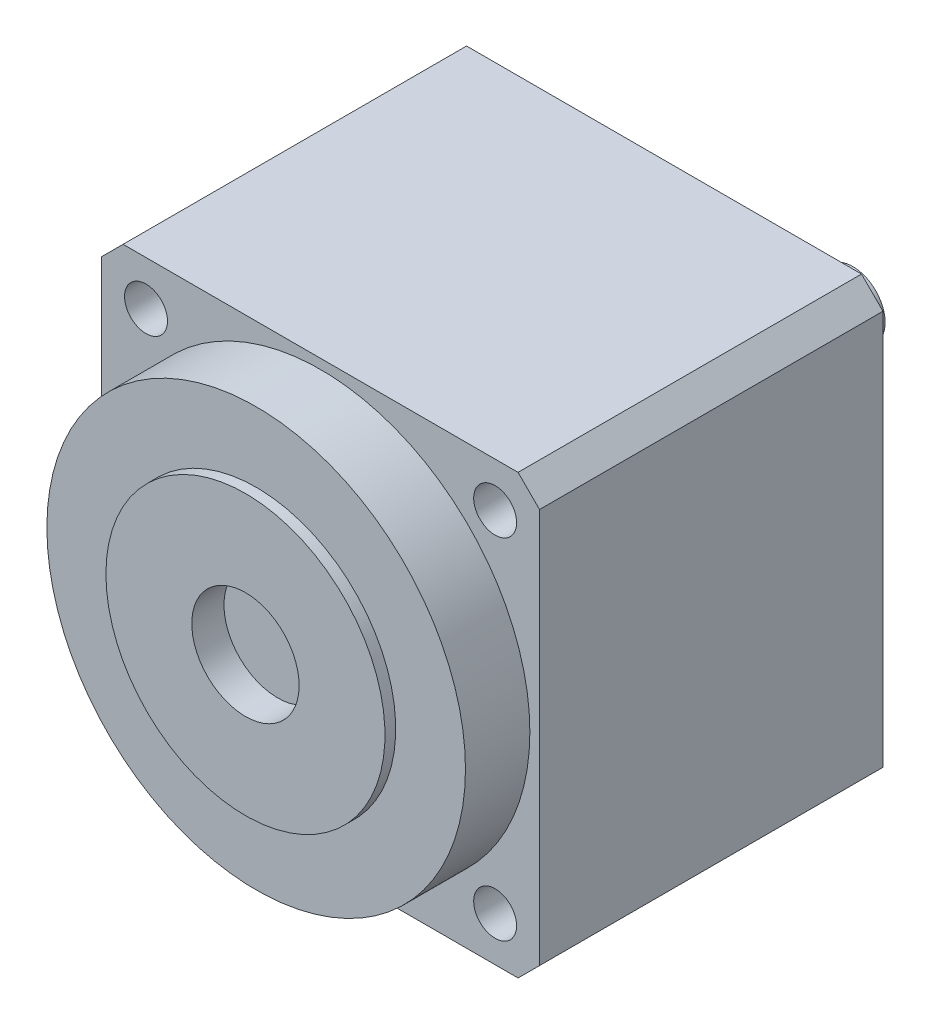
from build123d import *

# Parameters (mm, degrees)
SKETCH1_W         = 20.4
SKETCH1_H         = 20.4
EXTRUDE1_DEPTH    = 16
SKETCH14_R        = 9.75
EXTRUDE2_DEPTH    = 3
SKETCH33_R        = 6.5
EXTRUDE7_DEPTH    = 0.5
EXTRUDE3_START    = 0.5
SKETCH3_R         = 2.5
EXTRUDE3_DEPTH    = 1.5
SKETCH25_R        = 4.5
EXTRUDE6_DEPTH    = 0.8
SKETCH37_R        = 1.5
EXTRUDE8_DEPTH    = 8
CIRPATTERN1_COUNT = 4
CHAMFER1_SIZE     = 1


with BuildPart() as part:
    # Sketch1 → Extrude1 (new body)
    with BuildSketch(Plane.XY):
        with Locations((10.2, -10.2)):
            Rectangle(SKETCH1_W, SKETCH1_H)
    extrude(amount=EXTRUDE1_DEPTH)

    # Sketch14 → Extrude2 (add)
    with BuildSketch(Plane.XY.offset(16)):
        with Locations((10.2, -10.2)):
            Circle(SKETCH14_R)
    extrude(amount=EXTRUDE2_DEPTH)

    # Sketch33 → Extrude7 (add)
    with BuildSketch(Plane.XY.offset(19)):
        with Locations((10.2, -10.2)):
            Circle(SKETCH33_R)
    extrude(amount=EXTRUDE7_DEPTH)

    # Sketch3 → Extrude3 (cut)
    with BuildSketch(Plane.XY.offset(19).offset(EXTRUDE3_START)):
        with Locations((10.2, -10.2)):
            Circle(SKETCH3_R)
    extrude(amount=-EXTRUDE3_DEPTH, mode=Mode.SUBTRACT)

    # Sketch25 → Extrude6 (add)
    with BuildSketch(Plane(origin=(0, 0, 0), x_dir=(1, 0, 0), z_dir=(0, 0, -1))):
        with Locations((10.2, 10.2)):
            Circle(SKETCH25_R)
    extrude(amount=EXTRUDE6_DEPTH)

    # Sketch37 → Extrude8 (add)
    with BuildSketch(Plane(origin=(0, 0, -0.8), x_dir=(1, 0, 0), z_dir=(0, 0, -1))):
        with Locations(Location((10.2, 10.2, 0), (0, 0, 270))):
            Circle(SKETCH37_R)
    extrude(amount=EXTRUDE8_DEPTH)

    # Sketch41 → M2x0.4 Tapped Hole (revolve, cut)
    with BuildSketch(Plane(origin=(2.068272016, -2.068272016, 16), x_dir=(0, -1, 0), z_dir=(1, 0, 0))):
        Polygon((0, 0), (0, 3.480688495), (0.8, 3), (0.8, 2.8), (1, 2.8), (1, 0), align=None)
    m2x0_4_tapped_hole = revolve(axis=Axis((2.068272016, -2.068272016, 22.35), (0, 0, -1)), mode=Mode.SUBTRACT)

    # CirPattern1: M2x0.4 Tapped Hole ×4 about axis
    cirpattern1_axis = Axis((10.2, -10.2, 0), (0, 0, 1))
    for i in range(1, CIRPATTERN1_COUNT):
        add(m2x0_4_tapped_hole.rotate(cirpattern1_axis, i * 360 / CIRPATTERN1_COUNT), mode=Mode.SUBTRACT)

    # Chamfer1
    chamfer1_edges = [part.edges().sort_by_distance(p)[0] for p in [
        (0, 0, 8),
        (20.4, 0, 8),
        (20.4, -20.4, 8),
        (0, -20.4, 8),
    ]]
    chamfer(chamfer1_edges, length=CHAMFER1_SIZE)


solid = part.part
